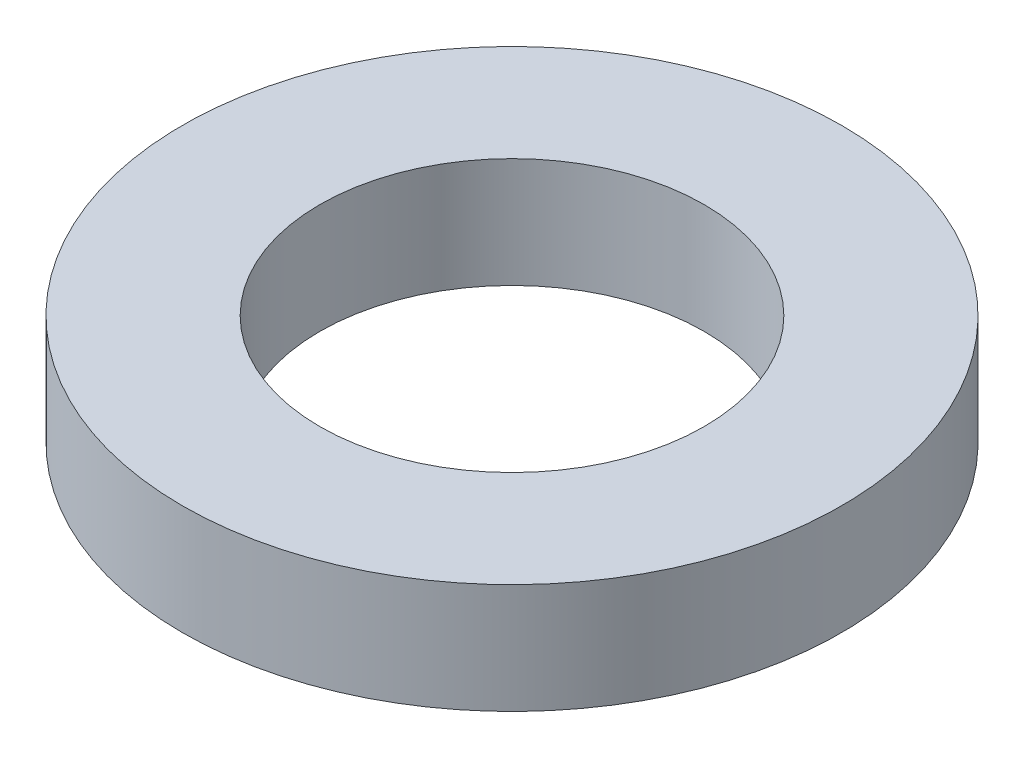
from build123d import *

# Parameters (mm, degrees)
SKETCH1_R           = 19.05
SKETCH1_R_2         = 11.1125
BOSS_EXTRUDE1_DEPTH = 6.35


with BuildPart() as part:
    # Sketch1 → Boss-Extrude1 (new body)
    with BuildSketch(Plane(origin=(0, 0, 0), x_dir=(1, 0, 0), z_dir=(0, 1, 0))):
        with Locations(Location((0, 0, 0), (0, 0, 270))):
            Circle(SKETCH1_R)
        with Locations(Location((0, 0, 0), (0, 0, 270))):
            Circle(SKETCH1_R_2, mode=Mode.SUBTRACT)
    extrude(amount=BOSS_EXTRUDE1_DEPTH)


solid = part.part
